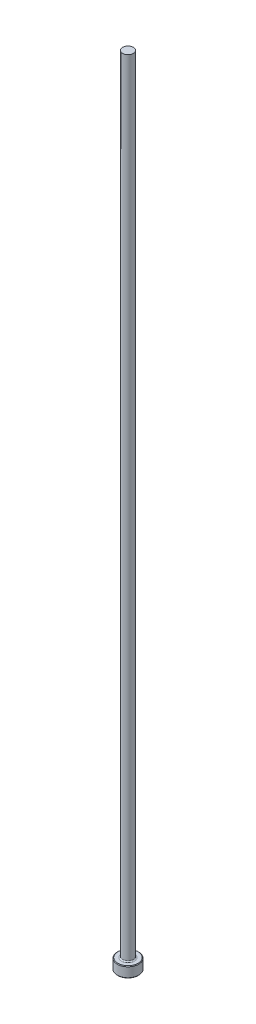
ISO-10303-21;
HEADER;
FILE_DESCRIPTION(('STEP AP214'),'2;1');
FILE_NAME('part.step','',(''),(''),'','','');
FILE_SCHEMA(('AUTOMOTIVE_DESIGN { 1 0 10303 214 1 1 1 1 }'));
ENDSEC;
DATA;
#1=APPLICATION_CONTEXT('core data for automotive mechanical design processes');
#2=APPLICATION_PROTOCOL_DEFINITION('international standard','automotive_design',2000,#1);
#3=PRODUCT_CONTEXT('',#1,'mechanical');
#4=PRODUCT('Part','Part','',(#3));
#5=PRODUCT_RELATED_PRODUCT_CATEGORY('part','',(#4));
#6=PRODUCT_DEFINITION_FORMATION('','',#4);
#7=PRODUCT_DEFINITION_CONTEXT('part definition',#1,'design');
#8=PRODUCT_DEFINITION('design','',#6,#7);
#9=PRODUCT_DEFINITION_SHAPE('','',#8);
#10=(LENGTH_UNIT() NAMED_UNIT(*) SI_UNIT(.MILLI.,.METRE.));
#11=(NAMED_UNIT(*) PLANE_ANGLE_UNIT() SI_UNIT($,.RADIAN.));
#12=(NAMED_UNIT(*) SI_UNIT($,.STERADIAN.) SOLID_ANGLE_UNIT());
#13=UNCERTAINTY_MEASURE_WITH_UNIT(LENGTH_MEASURE(1.E-05),#10,'distance_accuracy_value','');
#14=(GEOMETRIC_REPRESENTATION_CONTEXT(3) GLOBAL_UNCERTAINTY_ASSIGNED_CONTEXT((#13)) GLOBAL_UNIT_ASSIGNED_CONTEXT((#10,
#11,#12)) REPRESENTATION_CONTEXT('',''));
#15=CARTESIAN_POINT('',(0.,0.,0.));
#16=DIRECTION('',(0.,0.,1.));
#17=DIRECTION('',(1.,0.,0.));
#18=AXIS2_PLACEMENT_3D('',#15,#16,#17);
#19=CARTESIAN_POINT('',(0.,0.,0.));
#20=DIRECTION('',(0.,-1.,0.));
#21=DIRECTION('',(0.,0.,-1.));
#22=AXIS2_PLACEMENT_3D('',#19,#20,#21);
#23=PLANE('',#22);
#24=CARTESIAN_POINT('',(0.,0.,0.));
#25=DIRECTION('',(0.,-1.,0.));
#26=DIRECTION('',(0.,0.,-1.));
#27=AXIS2_PLACEMENT_3D('',#24,#25,#26);
#28=CIRCLE('',#27,4.50850000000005);
#29=CARTESIAN_POINT('',(0.,0.,-4.50850000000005));
#30=VERTEX_POINT('',#29);
#31=EDGE_CURVE('E46',#30,#30,#28,.T.);
#32=ORIENTED_EDGE('',*,*,#31,.T.);
#33=EDGE_LOOP('',(#32));
#34=FACE_BOUND('',#33,.T.);
#35=ADVANCED_FACE('F35',(#34),#23,.T.);
#36=CARTESIAN_POINT('',(0.,259.958771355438,0.));
#37=DIRECTION('',(0.,1.,0.));
#38=DIRECTION('',(0.,0.,1.));
#39=AXIS2_PLACEMENT_3D('',#36,#37,#38);
#40=CYLINDRICAL_SURFACE('',#39,4.76249999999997);
#41=CARTESIAN_POINT('',(0.,4.49579999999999,0.));
#42=DIRECTION('',(0.,1.,0.));
#43=DIRECTION('',(0.,0.,1.));
#44=AXIS2_PLACEMENT_3D('',#41,#42,#43);
#45=CIRCLE('',#44,4.76249999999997);
#46=CARTESIAN_POINT('',(0.,4.49579999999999,4.76249999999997));
#47=VERTEX_POINT('',#46);
#48=EDGE_CURVE('E50',#47,#47,#45,.F.);
#49=ORIENTED_EDGE('',*,*,#48,.T.);
#50=EDGE_LOOP('',(#49));
#51=FACE_BOUND('',#50,.T.);
#52=CARTESIAN_POINT('',(0.,0.253999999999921,0.));
#53=DIRECTION('',(0.,-1.,0.));
#54=DIRECTION('',(0.,0.,-1.));
#55=AXIS2_PLACEMENT_3D('',#52,#53,#54);
#56=CIRCLE('',#55,4.76249999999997);
#57=CARTESIAN_POINT('',(0.,0.253999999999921,-4.76249999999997));
#58=VERTEX_POINT('',#57);
#59=EDGE_CURVE('E55',#58,#58,#56,.F.);
#60=ORIENTED_EDGE('',*,*,#59,.T.);
#61=EDGE_LOOP('',(#60));
#62=FACE_BOUND('',#61,.T.);
#63=ADVANCED_FACE('F77',(#51,#62),#40,.T.);
#64=CARTESIAN_POINT('',(-4.76249999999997,4.7498,0.));
#65=DIRECTION('',(0.,1.,0.));
#66=DIRECTION('',(0.,0.,1.));
#67=AXIS2_PLACEMENT_3D('',#64,#65,#66);
#68=PLANE('',#67);
#69=CARTESIAN_POINT('',(0.,4.7498,0.));
#70=DIRECTION('',(0.,1.,0.));
#71=DIRECTION('',(0.,0.,1.));
#72=AXIS2_PLACEMENT_3D('',#69,#70,#71);
#73=CIRCLE('',#72,2.88924999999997);
#74=CARTESIAN_POINT('',(0.,4.7498,2.88924999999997));
#75=VERTEX_POINT('',#74);
#76=EDGE_CURVE('E10',#75,#75,#73,.F.);
#77=ORIENTED_EDGE('',*,*,#76,.T.);
#78=EDGE_LOOP('',(#77));
#79=FACE_BOUND('',#78,.T.);
#80=CARTESIAN_POINT('',(0.,4.7498,0.));
#81=DIRECTION('',(0.,1.,0.));
#82=DIRECTION('',(0.,0.,1.));
#83=AXIS2_PLACEMENT_3D('',#80,#81,#82);
#84=CIRCLE('',#83,4.5085);
#85=CARTESIAN_POINT('',(0.,4.7498,4.5085));
#86=VERTEX_POINT('',#85);
#87=EDGE_CURVE('E58',#86,#86,#84,.T.);
#88=ORIENTED_EDGE('',*,*,#87,.T.);
#89=EDGE_LOOP('',(#88));
#90=FACE_BOUND('',#89,.T.);
#91=ADVANCED_FACE('F69',(#79,#90),#68,.T.);
#92=CARTESIAN_POINT('',(0.,259.958771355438,0.));
#93=DIRECTION('',(0.,1.,0.));
#94=DIRECTION('',(0.,0.,1.));
#95=AXIS2_PLACEMENT_3D('',#92,#93,#94);
#96=CYLINDRICAL_SURFACE('',#95,2.38124999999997);
#97=CARTESIAN_POINT('',(0.,5.25779999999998,0.));
#98=DIRECTION('',(0.,1.,0.));
#99=DIRECTION('',(0.,0.,1.));
#100=AXIS2_PLACEMENT_3D('',#97,#98,#99);
#101=CIRCLE('',#100,2.38124999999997);
#102=CARTESIAN_POINT('',(0.,5.25779999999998,2.38124999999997));
#103=VERTEX_POINT('',#102);
#104=EDGE_CURVE('E42',#103,#103,#101,.T.);
#105=ORIENTED_EDGE('',*,*,#104,.T.);
#106=EDGE_LOOP('',(#105));
#107=FACE_BOUND('',#106,.T.);
#108=CARTESIAN_POINT('',(0.,355.6,0.));
#109=DIRECTION('',(0.,1.,0.));
#110=DIRECTION('',(0.,0.,1.));
#111=AXIS2_PLACEMENT_3D('',#108,#109,#110);
#112=CIRCLE('',#111,2.38124999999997);
#113=CARTESIAN_POINT('',(0.,355.6,2.38124999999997));
#114=VERTEX_POINT('',#113);
#115=EDGE_CURVE('E61',#114,#114,#112,.T.);
#116=ORIENTED_EDGE('',*,*,#115,.F.);
#117=EDGE_LOOP('',(#116));
#118=FACE_BOUND('',#117,.T.);
#119=ADVANCED_FACE('F67',(#107,#118),#96,.T.);
#120=CARTESIAN_POINT('',(-2.38124999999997,355.6,0.));
#121=DIRECTION('',(0.,1.,0.));
#122=DIRECTION('',(0.,0.,1.));
#123=AXIS2_PLACEMENT_3D('',#120,#121,#122);
#124=PLANE('',#123);
#125=ORIENTED_EDGE('',*,*,#115,.T.);
#126=EDGE_LOOP('',(#125));
#127=FACE_BOUND('',#126,.T.);
#128=ADVANCED_FACE('F65',(#127),#124,.T.);
#129=CARTESIAN_POINT('',(0.,4.74980000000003,0.));
#130=DIRECTION('',(0.,-1.,0.));
#131=DIRECTION('',(0.,0.,-1.));
#132=AXIS2_PLACEMENT_3D('',#129,#130,#131);
#133=CONICAL_SURFACE('',#132,4.50849999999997,0.78539816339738);
#134=ORIENTED_EDGE('',*,*,#48,.F.);
#135=EDGE_LOOP('',(#134));
#136=FACE_BOUND('',#135,.T.);
#137=ORIENTED_EDGE('',*,*,#87,.F.);
#138=EDGE_LOOP('',(#137));
#139=FACE_BOUND('',#138,.T.);
#140=ADVANCED_FACE('F75',(#136,#139),#133,.T.);
#141=CARTESIAN_POINT('',(0.,0.253999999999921,0.));
#142=DIRECTION('',(0.,1.,0.));
#143=DIRECTION('',(0.,0.,1.));
#144=AXIS2_PLACEMENT_3D('',#141,#142,#143);
#145=CONICAL_SURFACE('',#144,4.76249999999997,0.785398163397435);
#146=ORIENTED_EDGE('',*,*,#31,.F.);
#147=EDGE_LOOP('',(#146));
#148=FACE_BOUND('',#147,.T.);
#149=ORIENTED_EDGE('',*,*,#59,.F.);
#150=EDGE_LOOP('',(#149));
#151=FACE_BOUND('',#150,.T.);
#152=ADVANCED_FACE('F89',(#148,#151),#145,.T.);
#153=CARTESIAN_POINT('',(0.,5.25779999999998,0.));
#154=DIRECTION('',(0.,1.,0.));
#155=DIRECTION('',(0.,0.,1.));
#156=AXIS2_PLACEMENT_3D('',#153,#154,#155);
#157=TOROIDAL_SURFACE('',#156,2.88924999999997,0.508);
#158=ORIENTED_EDGE('',*,*,#76,.F.);
#159=EDGE_LOOP('',(#158));
#160=FACE_BOUND('',#159,.T.);
#161=ORIENTED_EDGE('',*,*,#104,.F.);
#162=EDGE_LOOP('',(#161));
#163=FACE_BOUND('',#162,.T.);
#164=ADVANCED_FACE('F37',(#160,#163),#157,.F.);
#165=CLOSED_SHELL('',(#35,#63,#91,#119,#128,#140,#152,#164));
#166=MANIFOLD_SOLID_BREP('B2',#165);
#167=ADVANCED_BREP_SHAPE_REPRESENTATION('',(#18,#166),#14);
#168=SHAPE_DEFINITION_REPRESENTATION(#9,#167);
ENDSEC;
END-ISO-10303-21;
